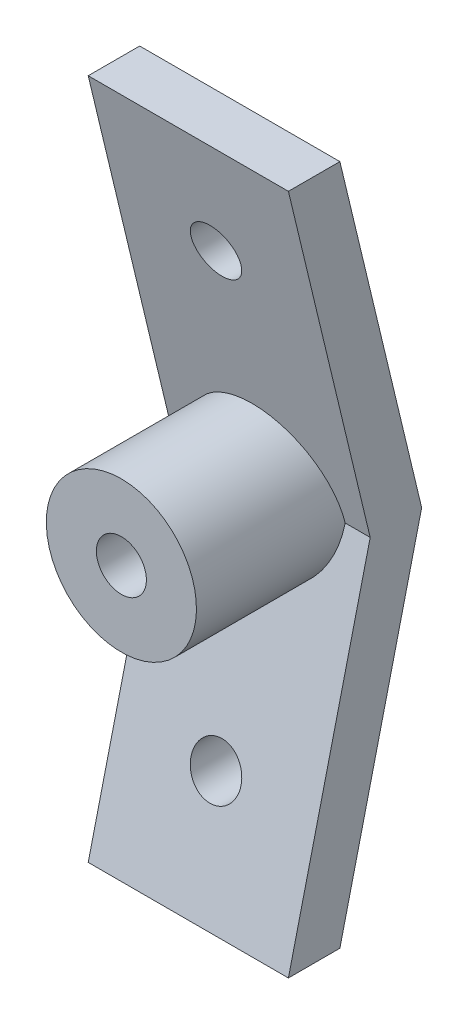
from build123d import *

# Parameters (mm, degrees)
BOSS_EXTRU_1_DEPTH      = 2
BOSS_EXTRU_1_DEPTH_BACK = 2
ESQUISSE6_R             = 0.5
ENL_V_MAT_EXTRU_1_DEPTH = 10


with BuildPart() as part:
    # Esquisse2 → R_volution1 (revolve)
    with BuildSketch(Plane(origin=(0, 0, 0), x_dir=(0, 0, -1), z_dir=(1, 0, 0))):
        Polygon((-2, 0.5), (-4, 0.5), (-4, 1.5), (-0.360118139, 1.5), (0, 0), (-2, 0), align=None)
    revolve(axis=Axis((0, 0, 0), (0, 0, 1)))


with BuildPart() as body_2:
    # Esquisse5 → Boss.-Extru.1 (new, two sides: drawn at the far end of the back side and taken through both)
    with BuildSketch(Plane(origin=(0, 0, 0), x_dir=(0, 0, -1), z_dir=(1, 0, 0)).offset(-BOSS_EXTRU_1_DEPTH_BACK)):
        Polygon((0, 0), (-1.634117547, 6.806589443), (-2.662532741, 6.806589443), (-1.028415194, 0), (-2.662532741, -6.806589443), (-1.634117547, -6.806589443), align=None)
    extrude(amount=BOSS_EXTRU_1_DEPTH + BOSS_EXTRU_1_DEPTH_BACK)

    # Esquisse6 → Enl_v. mat.-Extru.1 (cut)
    with BuildSketch(Plane.XY):
        with Locations(Location((0, 4.5, 0), (0, 0, 270))):
            Circle(ESQUISSE6_R)
        with Locations(Location((0, -4.5, 0), (0, 0, 90))):
            Circle(ESQUISSE6_R)
    extrude(amount=ENL_V_MAT_EXTRU_1_DEPTH, mode=Mode.SUBTRACT)


solid = Compound([part.part, body_2.part])
